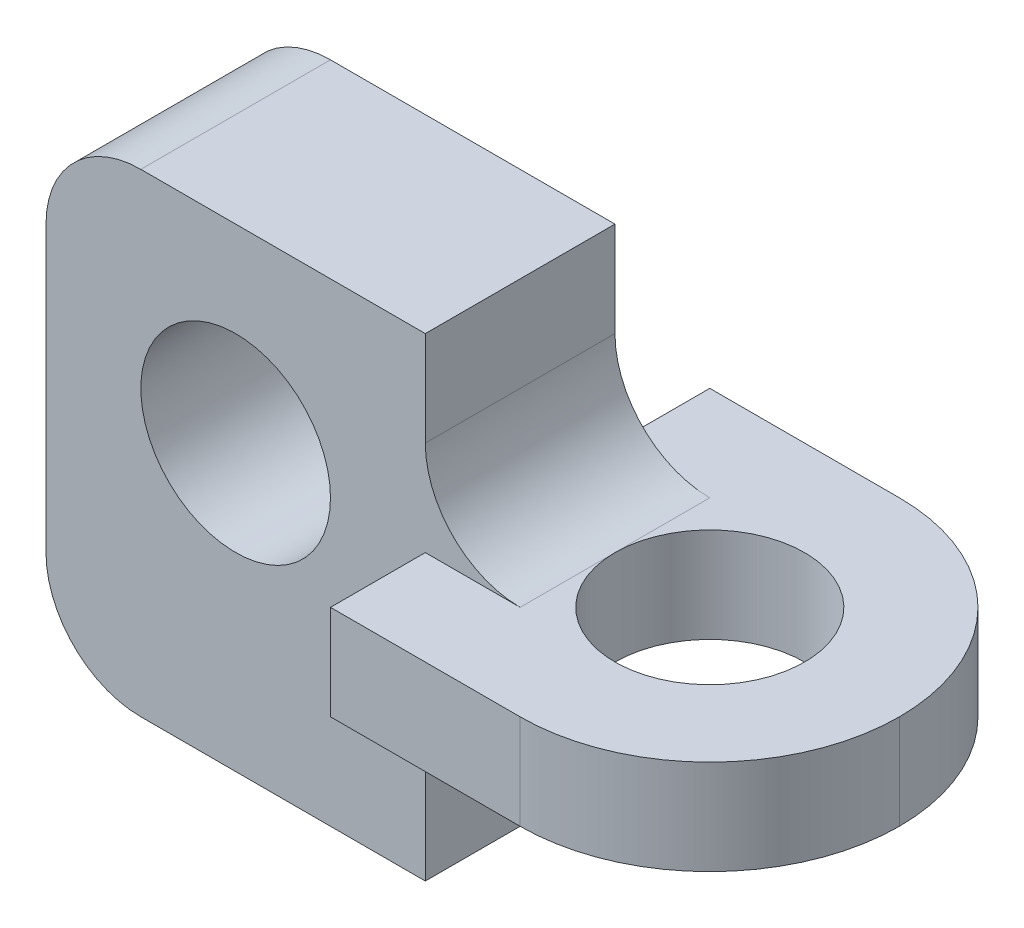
ISO-10303-21;
HEADER;
FILE_DESCRIPTION(('STEP AP214'),'2;1');
FILE_NAME('part.step','',(''),(''),'','','');
FILE_SCHEMA(('AUTOMOTIVE_DESIGN { 1 0 10303 214 1 1 1 1 }'));
ENDSEC;
DATA;
#1=APPLICATION_CONTEXT('core data for automotive mechanical design processes');
#2=APPLICATION_PROTOCOL_DEFINITION('international standard','automotive_design',2000,#1);
#3=PRODUCT_CONTEXT('',#1,'mechanical');
#4=PRODUCT('Part','Part','',(#3));
#5=PRODUCT_RELATED_PRODUCT_CATEGORY('part','',(#4));
#6=PRODUCT_DEFINITION_FORMATION('','',#4);
#7=PRODUCT_DEFINITION_CONTEXT('part definition',#1,'design');
#8=PRODUCT_DEFINITION('design','',#6,#7);
#9=PRODUCT_DEFINITION_SHAPE('','',#8);
#10=(LENGTH_UNIT() NAMED_UNIT(*) SI_UNIT(.MILLI.,.METRE.));
#11=(NAMED_UNIT(*) PLANE_ANGLE_UNIT() SI_UNIT($,.RADIAN.));
#12=(NAMED_UNIT(*) SI_UNIT($,.STERADIAN.) SOLID_ANGLE_UNIT());
#13=UNCERTAINTY_MEASURE_WITH_UNIT(LENGTH_MEASURE(1.E-05),#10,'distance_accuracy_value','');
#14=(GEOMETRIC_REPRESENTATION_CONTEXT(3) GLOBAL_UNCERTAINTY_ASSIGNED_CONTEXT((#13)) GLOBAL_UNIT_ASSIGNED_CONTEXT((#10,
#11,#12)) REPRESENTATION_CONTEXT('',''));
#15=CARTESIAN_POINT('',(0.,0.,0.));
#16=DIRECTION('',(0.,0.,1.));
#17=DIRECTION('',(1.,0.,0.));
#18=AXIS2_PLACEMENT_3D('',#15,#16,#17);
#19=CARTESIAN_POINT('',(20.,20.,10.));
#20=DIRECTION('',(-1.,0.,0.));
#21=DIRECTION('',(0.,-1.,0.));
#22=AXIS2_PLACEMENT_3D('',#19,#20,#21);
#23=PLANE('',#22);
#24=DIRECTION('',(0.,1.,0.));
#25=VECTOR('',#24,1.);
#26=CARTESIAN_POINT('',(20.,20.,10.));
#27=LINE('',#26,#25);
#28=CARTESIAN_POINT('',(20.,10.,10.));
#29=VERTEX_POINT('',#28);
#30=CARTESIAN_POINT('',(20.,20.,10.));
#31=VERTEX_POINT('',#30);
#32=EDGE_CURVE('E218',#29,#31,#27,.T.);
#33=ORIENTED_EDGE('',*,*,#32,.F.);
#34=DIRECTION('',(0.,0.,1.));
#35=VECTOR('',#34,1.);
#36=CARTESIAN_POINT('',(20.,10.,10.));
#37=LINE('',#36,#35);
#38=CARTESIAN_POINT('',(20.,10.,-10.));
#39=VERTEX_POINT('',#38);
#40=EDGE_CURVE('E278',#29,#39,#37,.F.);
#41=ORIENTED_EDGE('',*,*,#40,.T.);
#42=DIRECTION('',(0.,1.,0.));
#43=VECTOR('',#42,1.);
#44=CARTESIAN_POINT('',(20.,20.,-10.));
#45=LINE('',#44,#43);
#46=CARTESIAN_POINT('',(20.,20.,-10.));
#47=VERTEX_POINT('',#46);
#48=EDGE_CURVE('E230',#39,#47,#45,.T.);
#49=ORIENTED_EDGE('',*,*,#48,.T.);
#50=DIRECTION('',(0.,0.,-1.));
#51=VECTOR('',#50,1.);
#52=CARTESIAN_POINT('',(20.,20.,10.));
#53=LINE('',#52,#51);
#54=EDGE_CURVE('E225',#31,#47,#53,.T.);
#55=ORIENTED_EDGE('',*,*,#54,.F.);
#56=EDGE_LOOP('',(#33,#41,#49,#55));
#57=FACE_BOUND('',#56,.T.);
#58=ADVANCED_FACE('F42',(#57),#23,.F.);
#59=CARTESIAN_POINT('',(-20.,-30.,10.));
#60=DIRECTION('',(0.,0.,1.));
#61=DIRECTION('',(1.,0.,0.));
#62=AXIS2_PLACEMENT_3D('',#59,#60,#61);
#63=PLANE('',#62);
#64=DIRECTION('',(0.,-1.,0.));
#65=VECTOR('',#64,1.);
#66=CARTESIAN_POINT('',(-20.,20.,10.));
#67=LINE('',#66,#65);
#68=CARTESIAN_POINT('',(-20.,10.,10.));
#69=VERTEX_POINT('',#68);
#70=CARTESIAN_POINT('',(-20.,-20.,10.));
#71=VERTEX_POINT('',#70);
#72=EDGE_CURVE('E212',#69,#71,#67,.T.);
#73=ORIENTED_EDGE('',*,*,#72,.T.);
#74=CARTESIAN_POINT('',(-10.,-20.,10.));
#75=DIRECTION('',(0.,0.,1.));
#76=DIRECTION('',(1.,0.,0.));
#77=AXIS2_PLACEMENT_3D('',#74,#75,#76);
#78=CIRCLE('',#77,10.);
#79=CARTESIAN_POINT('',(-10.,-30.,10.));
#80=VERTEX_POINT('',#79);
#81=EDGE_CURVE('E294',#71,#80,#78,.T.);
#82=ORIENTED_EDGE('',*,*,#81,.T.);
#83=DIRECTION('',(1.,0.,0.));
#84=VECTOR('',#83,1.);
#85=CARTESIAN_POINT('',(-20.,-30.,10.));
#86=LINE('',#85,#84);
#87=CARTESIAN_POINT('',(20.,-30.,10.));
#88=VERTEX_POINT('',#87);
#89=EDGE_CURVE('E215',#80,#88,#86,.T.);
#90=ORIENTED_EDGE('',*,*,#89,.T.);
#91=CARTESIAN_POINT('',(20.,-20.,10.));
#92=VERTEX_POINT('',#91);
#93=EDGE_CURVE('E219',#88,#92,#27,.T.);
#94=ORIENTED_EDGE('',*,*,#93,.T.);
#95=CARTESIAN_POINT('',(30.,-20.,10.));
#96=DIRECTION('',(0.,0.,1.));
#97=DIRECTION('',(1.,0.,0.));
#98=AXIS2_PLACEMENT_3D('',#95,#96,#97);
#99=CIRCLE('',#98,10.);
#100=CARTESIAN_POINT('',(30.,-10.,10.));
#101=VERTEX_POINT('',#100);
#102=EDGE_CURVE('E298',#92,#101,#99,.F.);
#103=ORIENTED_EDGE('',*,*,#102,.T.);
#104=DIRECTION('',(1.,0.,0.));
#105=VECTOR('',#104,1.);
#106=CARTESIAN_POINT('',(20.,-10.,10.));
#107=LINE('',#106,#105);
#108=CARTESIAN_POINT('',(20.,-10.,10.));
#109=VERTEX_POINT('',#108);
#110=EDGE_CURVE('E64',#109,#101,#107,.T.);
#111=ORIENTED_EDGE('',*,*,#110,.F.);
#112=CARTESIAN_POINT('',(20.,0.,10.));
#113=VERTEX_POINT('',#112);
#114=EDGE_CURVE('E174',#109,#113,#27,.T.);
#115=ORIENTED_EDGE('',*,*,#114,.T.);
#116=DIRECTION('',(-1.,0.,0.));
#117=VECTOR('',#116,1.);
#118=CARTESIAN_POINT('',(-20.,0.,10.));
#119=LINE('',#118,#117);
#120=CARTESIAN_POINT('',(30.,0.,10.));
#121=VERTEX_POINT('',#120);
#122=EDGE_CURVE('E276',#121,#113,#119,.T.);
#123=ORIENTED_EDGE('',*,*,#122,.F.);
#124=CARTESIAN_POINT('',(30.,10.,10.));
#125=DIRECTION('',(0.,0.,1.));
#126=DIRECTION('',(1.,0.,0.));
#127=AXIS2_PLACEMENT_3D('',#124,#125,#126);
#128=CIRCLE('',#127,10.);
#129=EDGE_CURVE('E50',#121,#29,#128,.F.);
#130=ORIENTED_EDGE('',*,*,#129,.T.);
#131=ORIENTED_EDGE('',*,*,#32,.T.);
#132=DIRECTION('',(-1.,0.,0.));
#133=VECTOR('',#132,1.);
#134=CARTESIAN_POINT('',(-20.,20.,10.));
#135=LINE('',#134,#133);
#136=CARTESIAN_POINT('',(-10.,20.,10.));
#137=VERTEX_POINT('',#136);
#138=EDGE_CURVE('E222',#31,#137,#135,.T.);
#139=ORIENTED_EDGE('',*,*,#138,.T.);
#140=CARTESIAN_POINT('',(-10.,10.,10.));
#141=DIRECTION('',(0.,0.,1.));
#142=DIRECTION('',(1.,0.,0.));
#143=AXIS2_PLACEMENT_3D('',#140,#141,#142);
#144=CIRCLE('',#143,10.);
#145=EDGE_CURVE('E292',#137,#69,#144,.T.);
#146=ORIENTED_EDGE('',*,*,#145,.T.);
#147=EDGE_LOOP('',(#73,#82,#90,#94,#103,#111,#115,#123,#130,#131,#139,#146));
#148=FACE_BOUND('',#147,.T.);
#149=CARTESIAN_POINT('',(0.,0.,10.));
#150=DIRECTION('',(0.,0.,1.));
#151=DIRECTION('',(1.,0.,0.));
#152=AXIS2_PLACEMENT_3D('',#149,#150,#151);
#153=CIRCLE('',#152,10.);
#154=CARTESIAN_POINT('',(10.,0.,10.));
#155=VERTEX_POINT('',#154);
#156=EDGE_CURVE('E206',#155,#155,#153,.T.);
#157=ORIENTED_EDGE('',*,*,#156,.F.);
#158=EDGE_LOOP('',(#157));
#159=FACE_BOUND('',#158,.T.);
#160=ADVANCED_FACE('F303',(#148,#159),#63,.T.);
#161=CARTESIAN_POINT('',(-20.,-30.,-10.));
#162=DIRECTION('',(0.,0.,1.));
#163=DIRECTION('',(1.,0.,0.));
#164=AXIS2_PLACEMENT_3D('',#161,#162,#163);
#165=PLANE('',#164);
#166=DIRECTION('',(1.,0.,0.));
#167=VECTOR('',#166,1.);
#168=CARTESIAN_POINT('',(-20.,-30.,-10.));
#169=LINE('',#168,#167);
#170=CARTESIAN_POINT('',(-10.,-30.,-10.));
#171=VERTEX_POINT('',#170);
#172=CARTESIAN_POINT('',(20.,-30.,-10.));
#173=VERTEX_POINT('',#172);
#174=EDGE_CURVE('E228',#171,#173,#169,.T.);
#175=ORIENTED_EDGE('',*,*,#174,.F.);
#176=CARTESIAN_POINT('',(-10.,-20.,-10.));
#177=DIRECTION('',(0.,0.,1.));
#178=DIRECTION('',(1.,0.,0.));
#179=AXIS2_PLACEMENT_3D('',#176,#177,#178);
#180=CIRCLE('',#179,10.);
#181=CARTESIAN_POINT('',(-20.,-20.,-10.));
#182=VERTEX_POINT('',#181);
#183=EDGE_CURVE('E285',#171,#182,#180,.F.);
#184=ORIENTED_EDGE('',*,*,#183,.T.);
#185=DIRECTION('',(0.,-1.,0.));
#186=VECTOR('',#185,1.);
#187=CARTESIAN_POINT('',(-20.,20.,-10.));
#188=LINE('',#187,#186);
#189=CARTESIAN_POINT('',(-20.,10.,-10.));
#190=VERTEX_POINT('',#189);
#191=EDGE_CURVE('E209',#190,#182,#188,.T.);
#192=ORIENTED_EDGE('',*,*,#191,.F.);
#193=CARTESIAN_POINT('',(-10.,10.,-10.));
#194=DIRECTION('',(0.,0.,1.));
#195=DIRECTION('',(1.,0.,0.));
#196=AXIS2_PLACEMENT_3D('',#193,#194,#195);
#197=CIRCLE('',#196,10.);
#198=CARTESIAN_POINT('',(-10.,20.,-10.));
#199=VERTEX_POINT('',#198);
#200=EDGE_CURVE('E283',#190,#199,#197,.F.);
#201=ORIENTED_EDGE('',*,*,#200,.T.);
#202=DIRECTION('',(-1.,0.,0.));
#203=VECTOR('',#202,1.);
#204=CARTESIAN_POINT('',(-20.,20.,-10.));
#205=LINE('',#204,#203);
#206=EDGE_CURVE('E216',#47,#199,#205,.T.);
#207=ORIENTED_EDGE('',*,*,#206,.F.);
#208=ORIENTED_EDGE('',*,*,#48,.F.);
#209=CARTESIAN_POINT('',(30.,10.,-10.));
#210=DIRECTION('',(0.,0.,1.));
#211=DIRECTION('',(1.,0.,0.));
#212=AXIS2_PLACEMENT_3D('',#209,#210,#211);
#213=CIRCLE('',#212,10.);
#214=CARTESIAN_POINT('',(30.,0.,-10.));
#215=VERTEX_POINT('',#214);
#216=EDGE_CURVE('E13',#39,#215,#213,.T.);
#217=ORIENTED_EDGE('',*,*,#216,.T.);
#218=DIRECTION('',(1.,0.,0.));
#219=VECTOR('',#218,1.);
#220=CARTESIAN_POINT('',(20.,0.,-10.));
#221=LINE('',#220,#219);
#222=CARTESIAN_POINT('',(20.,0.,-10.));
#223=VERTEX_POINT('',#222);
#224=EDGE_CURVE('E56',#223,#215,#221,.T.);
#225=ORIENTED_EDGE('',*,*,#224,.F.);
#226=CARTESIAN_POINT('',(20.,-10.,-10.));
#227=VERTEX_POINT('',#226);
#228=EDGE_CURVE('E234',#227,#223,#45,.T.);
#229=ORIENTED_EDGE('',*,*,#228,.F.);
#230=DIRECTION('',(-1.,0.,0.));
#231=VECTOR('',#230,1.);
#232=CARTESIAN_POINT('',(-20.,-10.,-10.));
#233=LINE('',#232,#231);
#234=CARTESIAN_POINT('',(30.,-10.,-10.));
#235=VERTEX_POINT('',#234);
#236=EDGE_CURVE('E261',#235,#227,#233,.T.);
#237=ORIENTED_EDGE('',*,*,#236,.F.);
#238=CARTESIAN_POINT('',(30.,-20.,-10.));
#239=DIRECTION('',(0.,0.,1.));
#240=DIRECTION('',(1.,0.,0.));
#241=AXIS2_PLACEMENT_3D('',#238,#239,#240);
#242=CIRCLE('',#241,10.);
#243=CARTESIAN_POINT('',(20.,-20.,-10.));
#244=VERTEX_POINT('',#243);
#245=EDGE_CURVE('E300',#235,#244,#242,.T.);
#246=ORIENTED_EDGE('',*,*,#245,.T.);
#247=EDGE_CURVE('E231',#173,#244,#45,.T.);
#248=ORIENTED_EDGE('',*,*,#247,.F.);
#249=EDGE_LOOP('',(#175,#184,#192,#201,#207,#208,#217,#225,#229,#237,#246,#248));
#250=FACE_BOUND('',#249,.T.);
#251=CARTESIAN_POINT('',(0.,0.,-10.));
#252=DIRECTION('',(0.,0.,1.));
#253=DIRECTION('',(1.,0.,0.));
#254=AXIS2_PLACEMENT_3D('',#251,#252,#253);
#255=CIRCLE('',#254,10.);
#256=CARTESIAN_POINT('',(10.,0.,-10.));
#257=VERTEX_POINT('',#256);
#258=EDGE_CURVE('E204',#257,#257,#255,.T.);
#259=ORIENTED_EDGE('',*,*,#258,.T.);
#260=EDGE_LOOP('',(#259));
#261=FACE_BOUND('',#260,.T.);
#262=ADVANCED_FACE('F315',(#250,#261),#165,.F.);
#263=CARTESIAN_POINT('',(-20.,20.,10.));
#264=DIRECTION('',(1.,0.,0.));
#265=DIRECTION('',(0.,0.,-1.));
#266=AXIS2_PLACEMENT_3D('',#263,#264,#265);
#267=PLANE('',#266);
#268=ORIENTED_EDGE('',*,*,#191,.T.);
#269=DIRECTION('',(0.,0.,-1.));
#270=VECTOR('',#269,1.);
#271=CARTESIAN_POINT('',(-20.,-20.,10.));
#272=LINE('',#271,#270);
#273=EDGE_CURVE('E290',#182,#71,#272,.F.);
#274=ORIENTED_EDGE('',*,*,#273,.T.);
#275=ORIENTED_EDGE('',*,*,#72,.F.);
#276=DIRECTION('',(0.,0.,-1.));
#277=VECTOR('',#276,1.);
#278=CARTESIAN_POINT('',(-20.,10.,10.));
#279=LINE('',#278,#277);
#280=EDGE_CURVE('E287',#69,#190,#279,.T.);
#281=ORIENTED_EDGE('',*,*,#280,.T.);
#282=EDGE_LOOP('',(#268,#274,#275,#281));
#283=FACE_BOUND('',#282,.T.);
#284=ADVANCED_FACE('F338',(#283),#267,.F.);
#285=CARTESIAN_POINT('',(-20.,-30.,10.));
#286=DIRECTION('',(0.,1.,0.));
#287=DIRECTION('',(0.,0.,1.));
#288=AXIS2_PLACEMENT_3D('',#285,#286,#287);
#289=PLANE('',#288);
#290=ORIENTED_EDGE('',*,*,#89,.F.);
#291=DIRECTION('',(0.,0.,-1.));
#292=VECTOR('',#291,1.);
#293=CARTESIAN_POINT('',(-10.,-30.,10.));
#294=LINE('',#293,#292);
#295=EDGE_CURVE('E280',#80,#171,#294,.T.);
#296=ORIENTED_EDGE('',*,*,#295,.T.);
#297=ORIENTED_EDGE('',*,*,#174,.T.);
#298=DIRECTION('',(0.,0.,-1.));
#299=VECTOR('',#298,1.);
#300=CARTESIAN_POINT('',(20.,-30.,10.));
#301=LINE('',#300,#299);
#302=EDGE_CURVE('E239',#88,#173,#301,.T.);
#303=ORIENTED_EDGE('',*,*,#302,.F.);
#304=EDGE_LOOP('',(#290,#296,#297,#303));
#305=FACE_BOUND('',#304,.T.);
#306=ADVANCED_FACE('F346',(#305),#289,.F.);
#307=ORIENTED_EDGE('',*,*,#247,.T.);
#308=DIRECTION('',(0.,0.,1.));
#309=VECTOR('',#308,1.);
#310=CARTESIAN_POINT('',(20.,-20.,10.));
#311=LINE('',#310,#309);
#312=EDGE_CURVE('E254',#244,#92,#311,.T.);
#313=ORIENTED_EDGE('',*,*,#312,.T.);
#314=ORIENTED_EDGE('',*,*,#93,.F.);
#315=ORIENTED_EDGE('',*,*,#302,.T.);
#316=EDGE_LOOP('',(#307,#313,#314,#315));
#317=FACE_BOUND('',#316,.T.);
#318=ADVANCED_FACE('F352',(#317),#23,.F.);
#319=CARTESIAN_POINT('',(-20.,20.,10.));
#320=DIRECTION('',(0.,-1.,0.));
#321=DIRECTION('',(0.,0.,-1.));
#322=AXIS2_PLACEMENT_3D('',#319,#320,#321);
#323=PLANE('',#322);
#324=ORIENTED_EDGE('',*,*,#206,.T.);
#325=DIRECTION('',(0.,0.,-1.));
#326=VECTOR('',#325,1.);
#327=CARTESIAN_POINT('',(-10.,20.,10.));
#328=LINE('',#327,#326);
#329=EDGE_CURVE('E296',#199,#137,#328,.F.);
#330=ORIENTED_EDGE('',*,*,#329,.T.);
#331=ORIENTED_EDGE('',*,*,#138,.F.);
#332=ORIENTED_EDGE('',*,*,#54,.T.);
#333=EDGE_LOOP('',(#324,#330,#331,#332));
#334=FACE_BOUND('',#333,.T.);
#335=ADVANCED_FACE('F330',(#334),#323,.F.);
#336=CARTESIAN_POINT('',(0.,0.,10.));
#337=DIRECTION('',(0.,0.,-1.));
#338=DIRECTION('',(-1.,0.,0.));
#339=AXIS2_PLACEMENT_3D('',#336,#337,#338);
#340=CYLINDRICAL_SURFACE('',#339,10.);
#341=ORIENTED_EDGE('',*,*,#156,.T.);
#342=EDGE_LOOP('',(#341));
#343=FACE_BOUND('',#342,.T.);
#344=ORIENTED_EDGE('',*,*,#258,.F.);
#345=EDGE_LOOP('',(#344));
#346=FACE_BOUND('',#345,.T.);
#347=ADVANCED_FACE('F398',(#343,#346),#340,.F.);
#348=CARTESIAN_POINT('',(20.,-10.,-20.));
#349=DIRECTION('',(-1.,0.,0.));
#350=DIRECTION('',(0.,0.,1.));
#351=AXIS2_PLACEMENT_3D('',#348,#349,#350);
#352=PLANE('',#351);
#353=ORIENTED_EDGE('',*,*,#114,.F.);
#354=DIRECTION('',(0.,0.,1.));
#355=VECTOR('',#354,1.);
#356=CARTESIAN_POINT('',(20.,-10.,-20.));
#357=LINE('',#356,#355);
#358=CARTESIAN_POINT('',(20.,-10.,20.));
#359=VERTEX_POINT('',#358);
#360=EDGE_CURVE('E168',#109,#359,#357,.T.);
#361=ORIENTED_EDGE('',*,*,#360,.T.);
#362=DIRECTION('',(0.,1.,0.));
#363=VECTOR('',#362,1.);
#364=CARTESIAN_POINT('',(20.,-10.,20.));
#365=LINE('',#364,#363);
#366=CARTESIAN_POINT('',(20.,0.,20.));
#367=VERTEX_POINT('',#366);
#368=EDGE_CURVE('E172',#359,#367,#365,.T.);
#369=ORIENTED_EDGE('',*,*,#368,.T.);
#370=DIRECTION('',(0.,0.,1.));
#371=VECTOR('',#370,1.);
#372=CARTESIAN_POINT('',(20.,0.,-20.));
#373=LINE('',#372,#371);
#374=EDGE_CURVE('E200',#113,#367,#373,.T.);
#375=ORIENTED_EDGE('',*,*,#374,.F.);
#376=EDGE_LOOP('',(#353,#361,#369,#375));
#377=FACE_BOUND('',#376,.T.);
#378=ADVANCED_FACE('F170',(#377),#352,.T.);
#379=CARTESIAN_POINT('',(20.,-10.,-20.));
#380=VERTEX_POINT('',#379);
#381=EDGE_CURVE('E177',#380,#227,#357,.T.);
#382=ORIENTED_EDGE('',*,*,#381,.T.);
#383=ORIENTED_EDGE('',*,*,#228,.T.);
#384=CARTESIAN_POINT('',(20.,0.,-20.));
#385=VERTEX_POINT('',#384);
#386=EDGE_CURVE('E198',#385,#223,#373,.T.);
#387=ORIENTED_EDGE('',*,*,#386,.F.);
#388=DIRECTION('',(0.,1.,0.));
#389=VECTOR('',#388,1.);
#390=CARTESIAN_POINT('',(20.,-10.,-20.));
#391=LINE('',#390,#389);
#392=EDGE_CURVE('E187',#380,#385,#391,.T.);
#393=ORIENTED_EDGE('',*,*,#392,.F.);
#394=EDGE_LOOP('',(#382,#383,#387,#393));
#395=FACE_BOUND('',#394,.T.);
#396=ADVANCED_FACE('F327',(#395),#352,.T.);
#397=CARTESIAN_POINT('',(20.,-10.,-20.));
#398=DIRECTION('',(0.,0.,-1.));
#399=DIRECTION('',(-1.,0.,0.));
#400=AXIS2_PLACEMENT_3D('',#397,#398,#399);
#401=PLANE('',#400);
#402=DIRECTION('',(-1.,0.,0.));
#403=VECTOR('',#402,1.);
#404=CARTESIAN_POINT('',(20.,0.,-20.));
#405=LINE('',#404,#403);
#406=CARTESIAN_POINT('',(40.,0.,-20.));
#407=VERTEX_POINT('',#406);
#408=EDGE_CURVE('E178',#407,#385,#405,.T.);
#409=ORIENTED_EDGE('',*,*,#408,.F.);
#410=DIRECTION('',(0.,1.,0.));
#411=VECTOR('',#410,1.);
#412=CARTESIAN_POINT('',(40.,-10.,-20.));
#413=LINE('',#412,#411);
#414=CARTESIAN_POINT('',(40.,-10.,-20.));
#415=VERTEX_POINT('',#414);
#416=EDGE_CURVE('E246',#407,#415,#413,.F.);
#417=ORIENTED_EDGE('',*,*,#416,.T.);
#418=DIRECTION('',(-1.,0.,0.));
#419=VECTOR('',#418,1.);
#420=CARTESIAN_POINT('',(20.,-10.,-20.));
#421=LINE('',#420,#419);
#422=EDGE_CURVE('E188',#415,#380,#421,.T.);
#423=ORIENTED_EDGE('',*,*,#422,.T.);
#424=ORIENTED_EDGE('',*,*,#392,.T.);
#425=EDGE_LOOP('',(#409,#417,#423,#424));
#426=FACE_BOUND('',#425,.T.);
#427=ADVANCED_FACE('F374',(#426),#401,.T.);
#428=CARTESIAN_POINT('',(20.,-10.,20.));
#429=DIRECTION('',(0.,0.,1.));
#430=DIRECTION('',(1.,0.,0.));
#431=AXIS2_PLACEMENT_3D('',#428,#429,#430);
#432=PLANE('',#431);
#433=DIRECTION('',(1.,0.,0.));
#434=VECTOR('',#433,1.);
#435=CARTESIAN_POINT('',(20.,-10.,20.));
#436=LINE('',#435,#434);
#437=CARTESIAN_POINT('',(40.,-10.,20.));
#438=VERTEX_POINT('',#437);
#439=EDGE_CURVE('E183',#359,#438,#436,.T.);
#440=ORIENTED_EDGE('',*,*,#439,.T.);
#441=DIRECTION('',(0.,1.,0.));
#442=VECTOR('',#441,1.);
#443=CARTESIAN_POINT('',(40.,-10.,20.));
#444=LINE('',#443,#442);
#445=CARTESIAN_POINT('',(40.,0.,20.));
#446=VERTEX_POINT('',#445);
#447=EDGE_CURVE('E252',#438,#446,#444,.T.);
#448=ORIENTED_EDGE('',*,*,#447,.T.);
#449=DIRECTION('',(1.,0.,0.));
#450=VECTOR('',#449,1.);
#451=CARTESIAN_POINT('',(20.,0.,20.));
#452=LINE('',#451,#450);
#453=EDGE_CURVE('E186',#367,#446,#452,.T.);
#454=ORIENTED_EDGE('',*,*,#453,.F.);
#455=ORIENTED_EDGE('',*,*,#368,.F.);
#456=EDGE_LOOP('',(#440,#448,#454,#455));
#457=FACE_BOUND('',#456,.T.);
#458=ADVANCED_FACE('F182',(#457),#432,.T.);
#459=CARTESIAN_POINT('',(20.,-10.,20.));
#460=DIRECTION('',(0.,1.,0.));
#461=DIRECTION('',(0.,0.,1.));
#462=AXIS2_PLACEMENT_3D('',#459,#460,#461);
#463=PLANE('',#462);
#464=ORIENTED_EDGE('',*,*,#360,.F.);
#465=ORIENTED_EDGE('',*,*,#110,.T.);
#466=DIRECTION('',(0.,0.,1.));
#467=VECTOR('',#466,1.);
#468=CARTESIAN_POINT('',(30.,-10.,-10.));
#469=LINE('',#468,#467);
#470=CARTESIAN_POINT('',(30.,-10.,0.));
#471=VERTEX_POINT('',#470);
#472=EDGE_CURVE('E266',#101,#471,#469,.F.);
#473=ORIENTED_EDGE('',*,*,#472,.T.);
#474=CARTESIAN_POINT('',(40.,-10.,0.));
#475=DIRECTION('',(0.,1.,0.));
#476=DIRECTION('',(0.,0.,1.));
#477=AXIS2_PLACEMENT_3D('',#474,#475,#476);
#478=CIRCLE('',#477,10.);
#479=EDGE_CURVE('E258',#471,#471,#478,.T.);
#480=ORIENTED_EDGE('',*,*,#479,.T.);
#481=DIRECTION('',(0.,0.,1.));
#482=VECTOR('',#481,1.);
#483=CARTESIAN_POINT('',(30.,-10.,-10.));
#484=LINE('',#483,#482);
#485=EDGE_CURVE('E263',#471,#235,#484,.F.);
#486=ORIENTED_EDGE('',*,*,#485,.T.);
#487=ORIENTED_EDGE('',*,*,#236,.T.);
#488=ORIENTED_EDGE('',*,*,#381,.F.);
#489=ORIENTED_EDGE('',*,*,#422,.F.);
#490=CARTESIAN_POINT('',(40.,-10.,0.));
#491=DIRECTION('',(0.,1.,0.));
#492=DIRECTION('',(0.,0.,1.));
#493=AXIS2_PLACEMENT_3D('',#490,#491,#492);
#494=CIRCLE('',#493,20.);
#495=CARTESIAN_POINT('',(60.,-10.,0.));
#496=VERTEX_POINT('',#495);
#497=EDGE_CURVE('E250',#415,#496,#494,.F.);
#498=ORIENTED_EDGE('',*,*,#497,.T.);
#499=CARTESIAN_POINT('',(40.,-10.,0.));
#500=DIRECTION('',(0.,1.,0.));
#501=DIRECTION('',(0.,0.,1.));
#502=AXIS2_PLACEMENT_3D('',#499,#500,#501);
#503=CIRCLE('',#502,20.);
#504=EDGE_CURVE('E192',#496,#438,#503,.F.);
#505=ORIENTED_EDGE('',*,*,#504,.T.);
#506=ORIENTED_EDGE('',*,*,#439,.F.);
#507=EDGE_LOOP('',(#464,#465,#473,#480,#486,#487,#488,#489,#498,#505,#506));
#508=FACE_BOUND('',#507,.T.);
#509=ADVANCED_FACE('F190',(#508),#463,.F.);
#510=CARTESIAN_POINT('',(20.,0.,20.));
#511=DIRECTION('',(0.,1.,0.));
#512=DIRECTION('',(0.,0.,1.));
#513=AXIS2_PLACEMENT_3D('',#510,#511,#512);
#514=PLANE('',#513);
#515=DIRECTION('',(0.,0.,1.));
#516=VECTOR('',#515,1.);
#517=CARTESIAN_POINT('',(30.,0.,20.));
#518=LINE('',#517,#516);
#519=CARTESIAN_POINT('',(30.,0.,0.));
#520=VERTEX_POINT('',#519);
#521=EDGE_CURVE('E273',#520,#121,#518,.T.);
#522=ORIENTED_EDGE('',*,*,#521,.T.);
#523=ORIENTED_EDGE('',*,*,#122,.T.);
#524=ORIENTED_EDGE('',*,*,#374,.T.);
#525=ORIENTED_EDGE('',*,*,#453,.T.);
#526=CARTESIAN_POINT('',(40.,0.,0.));
#527=DIRECTION('',(0.,1.,0.));
#528=DIRECTION('',(0.,0.,1.));
#529=AXIS2_PLACEMENT_3D('',#526,#527,#528);
#530=CIRCLE('',#529,20.);
#531=CARTESIAN_POINT('',(60.,0.,0.));
#532=VERTEX_POINT('',#531);
#533=EDGE_CURVE('E242',#446,#532,#530,.T.);
#534=ORIENTED_EDGE('',*,*,#533,.T.);
#535=CARTESIAN_POINT('',(40.,0.,0.));
#536=DIRECTION('',(0.,1.,0.));
#537=DIRECTION('',(0.,0.,1.));
#538=AXIS2_PLACEMENT_3D('',#535,#536,#537);
#539=CIRCLE('',#538,20.);
#540=EDGE_CURVE('E244',#532,#407,#539,.T.);
#541=ORIENTED_EDGE('',*,*,#540,.T.);
#542=ORIENTED_EDGE('',*,*,#408,.T.);
#543=ORIENTED_EDGE('',*,*,#386,.T.);
#544=ORIENTED_EDGE('',*,*,#224,.T.);
#545=DIRECTION('',(0.,0.,1.));
#546=VECTOR('',#545,1.);
#547=CARTESIAN_POINT('',(30.,0.,20.));
#548=LINE('',#547,#546);
#549=EDGE_CURVE('E270',#215,#520,#548,.T.);
#550=ORIENTED_EDGE('',*,*,#549,.T.);
#551=CARTESIAN_POINT('',(40.,0.,0.));
#552=DIRECTION('',(0.,1.,0.));
#553=DIRECTION('',(0.,0.,1.));
#554=AXIS2_PLACEMENT_3D('',#551,#552,#553);
#555=CIRCLE('',#554,10.);
#556=EDGE_CURVE('E361',#520,#520,#555,.T.);
#557=ORIENTED_EDGE('',*,*,#556,.F.);
#558=EDGE_LOOP('',(#522,#523,#524,#525,#534,#541,#542,#543,#544,#550,#557));
#559=FACE_BOUND('',#558,.T.);
#560=ADVANCED_FACE('F319',(#559),#514,.T.);
#561=CARTESIAN_POINT('',(40.,-10.,0.));
#562=DIRECTION('',(0.,1.,0.));
#563=DIRECTION('',(0.,0.,1.));
#564=AXIS2_PLACEMENT_3D('',#561,#562,#563);
#565=CYLINDRICAL_SURFACE('',#564,20.);
#566=ORIENTED_EDGE('',*,*,#447,.F.);
#567=ORIENTED_EDGE('',*,*,#504,.F.);
#568=DIRECTION('',(0.,1.,0.));
#569=VECTOR('',#568,1.);
#570=CARTESIAN_POINT('',(60.,-10.,0.));
#571=LINE('',#570,#569);
#572=EDGE_CURVE('E255',#532,#496,#571,.F.);
#573=ORIENTED_EDGE('',*,*,#572,.F.);
#574=ORIENTED_EDGE('',*,*,#533,.F.);
#575=EDGE_LOOP('',(#566,#567,#573,#574));
#576=FACE_BOUND('',#575,.T.);
#577=ADVANCED_FACE('F368',(#576),#565,.T.);
#578=CARTESIAN_POINT('',(40.,-10.,0.));
#579=DIRECTION('',(0.,1.,0.));
#580=DIRECTION('',(0.,0.,1.));
#581=AXIS2_PLACEMENT_3D('',#578,#579,#580);
#582=CYLINDRICAL_SURFACE('',#581,20.);
#583=ORIENTED_EDGE('',*,*,#497,.F.);
#584=ORIENTED_EDGE('',*,*,#416,.F.);
#585=ORIENTED_EDGE('',*,*,#540,.F.);
#586=ORIENTED_EDGE('',*,*,#572,.T.);
#587=EDGE_LOOP('',(#583,#584,#585,#586));
#588=FACE_BOUND('',#587,.T.);
#589=ADVANCED_FACE('F372',(#588),#582,.T.);
#590=CARTESIAN_POINT('',(40.,-30.,0.));
#591=DIRECTION('',(0.,1.,0.));
#592=DIRECTION('',(0.,0.,1.));
#593=AXIS2_PLACEMENT_3D('',#590,#591,#592);
#594=CYLINDRICAL_SURFACE('',#593,10.);
#595=ORIENTED_EDGE('',*,*,#556,.T.);
#596=EDGE_LOOP('',(#595));
#597=FACE_BOUND('',#596,.T.);
#598=ORIENTED_EDGE('',*,*,#479,.F.);
#599=EDGE_LOOP('',(#598));
#600=FACE_BOUND('',#599,.T.);
#601=ADVANCED_FACE('F364',(#597,#600),#594,.F.);
#602=CARTESIAN_POINT('',(30.,-20.,10.));
#603=DIRECTION('',(0.,0.,-1.));
#604=DIRECTION('',(-1.,0.,0.));
#605=AXIS2_PLACEMENT_3D('',#602,#603,#604);
#606=CYLINDRICAL_SURFACE('',#605,10.);
#607=ORIENTED_EDGE('',*,*,#485,.F.);
#608=ORIENTED_EDGE('',*,*,#472,.F.);
#609=ORIENTED_EDGE('',*,*,#102,.F.);
#610=ORIENTED_EDGE('',*,*,#312,.F.);
#611=ORIENTED_EDGE('',*,*,#245,.F.);
#612=EDGE_LOOP('',(#607,#608,#609,#610,#611));
#613=FACE_BOUND('',#612,.T.);
#614=ADVANCED_FACE('F356',(#613),#606,.F.);
#615=CARTESIAN_POINT('',(30.,10.,20.));
#616=DIRECTION('',(0.,0.,1.));
#617=DIRECTION('',(1.,0.,0.));
#618=AXIS2_PLACEMENT_3D('',#615,#616,#617);
#619=CYLINDRICAL_SURFACE('',#618,10.);
#620=ORIENTED_EDGE('',*,*,#216,.F.);
#621=ORIENTED_EDGE('',*,*,#40,.F.);
#622=ORIENTED_EDGE('',*,*,#129,.F.);
#623=ORIENTED_EDGE('',*,*,#521,.F.);
#624=ORIENTED_EDGE('',*,*,#549,.F.);
#625=EDGE_LOOP('',(#620,#621,#622,#623,#624));
#626=FACE_BOUND('',#625,.T.);
#627=ADVANCED_FACE('F312',(#626),#619,.F.);
#628=CARTESIAN_POINT('',(-10.,-20.,10.));
#629=DIRECTION('',(0.,0.,-1.));
#630=DIRECTION('',(-1.,0.,0.));
#631=AXIS2_PLACEMENT_3D('',#628,#629,#630);
#632=CYLINDRICAL_SURFACE('',#631,10.);
#633=ORIENTED_EDGE('',*,*,#81,.F.);
#634=ORIENTED_EDGE('',*,*,#273,.F.);
#635=ORIENTED_EDGE('',*,*,#183,.F.);
#636=ORIENTED_EDGE('',*,*,#295,.F.);
#637=EDGE_LOOP('',(#633,#634,#635,#636));
#638=FACE_BOUND('',#637,.T.);
#639=ADVANCED_FACE('F344',(#638),#632,.T.);
#640=CARTESIAN_POINT('',(-10.,10.,10.));
#641=DIRECTION('',(0.,0.,-1.));
#642=DIRECTION('',(-1.,0.,0.));
#643=AXIS2_PLACEMENT_3D('',#640,#641,#642);
#644=CYLINDRICAL_SURFACE('',#643,10.);
#645=ORIENTED_EDGE('',*,*,#145,.F.);
#646=ORIENTED_EDGE('',*,*,#329,.F.);
#647=ORIENTED_EDGE('',*,*,#200,.F.);
#648=ORIENTED_EDGE('',*,*,#280,.F.);
#649=EDGE_LOOP('',(#645,#646,#647,#648));
#650=FACE_BOUND('',#649,.T.);
#651=ADVANCED_FACE('F44',(#650),#644,.T.);
#652=CLOSED_SHELL('',(#58,#160,#262,#284,#306,#318,#335,#347,#378,#396,#427,#458,#509,#560,#577,
#589,#601,#614,#627,#639,#651));
#653=MANIFOLD_SOLID_BREP('B2',#652);
#654=ADVANCED_BREP_SHAPE_REPRESENTATION('',(#18,#653),#14);
#655=SHAPE_DEFINITION_REPRESENTATION(#9,#654);
ENDSEC;
END-ISO-10303-21;
